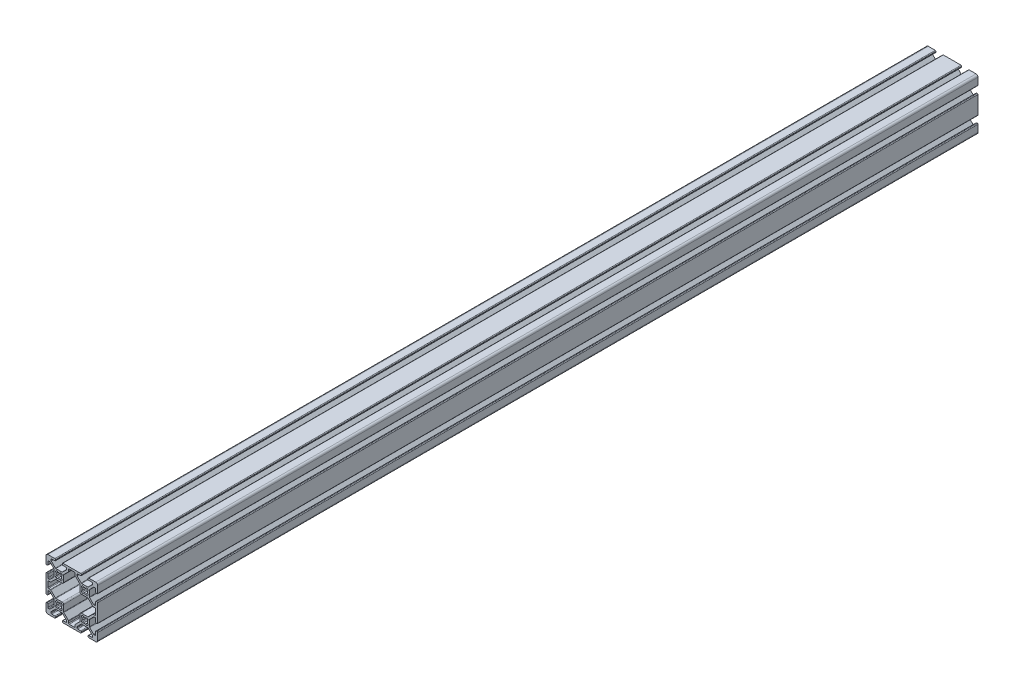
from build123d import *

# Parameters (mm, degrees)
EXTRUDE1_DEPTH = 682.117


with BuildPart() as part:
    # Sketch1 → Extrude1 (new body)
    with BuildSketch(Plane.XY):
        with BuildLine():
            Line((-36.908207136, -152.779600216), (-32.140368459, -152.779600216))
            ThreePointArc((-32.140368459, -152.779600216), (-31.945965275, -152.818269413), (-31.781158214, -152.928389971))
            Line((-31.781158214, -152.928389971), (-28.678077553, -156.031470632))
            ThreePointArc((-28.678077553, -156.031470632), (-28.567956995, -156.196277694), (-28.529287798, -156.390680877))
            Line((-28.529287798, -156.390680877), (-28.529287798, -157.116600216))
            ThreePointArc((-28.529287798, -157.116600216), (-28.678077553, -157.475810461), (-29.037287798, -157.624600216))
            Line((-29.037287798, -157.624600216), (-31.386287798, -157.624600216))
            ThreePointArc((-31.386287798, -157.624600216), (-31.745498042, -157.773389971), (-31.894287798, -158.132600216))
            Line((-31.894287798, -158.132600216), (-31.894287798, -158.616600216))
            ThreePointArc((-31.894287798, -158.616600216), (-31.745498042, -158.975810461), (-31.386287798, -159.124600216))
            Line((-31.386287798, -159.124600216), (-17.662287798, -159.124600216))
            ThreePointArc((-17.662287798, -159.124600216), (-17.303077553, -158.975810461), (-17.154287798, -158.616600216))
            Line((-17.154287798, -158.616600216), (-17.154287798, -158.132600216))
            ThreePointArc((-17.154287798, -158.132600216), (-17.303077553, -157.773389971), (-17.662287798, -157.624600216))
            Line((-17.662287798, -157.624600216), (-20.011287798, -157.624600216))
            ThreePointArc((-20.011287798, -157.624600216), (-20.370498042, -157.475810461), (-20.519287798, -157.116600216))
            Line((-20.519287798, -157.116600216), (-20.519287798, -156.390680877))
            ThreePointArc((-20.519287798, -156.390680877), (-20.4806186, -156.196277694), (-20.370498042, -156.031470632))
            Line((-20.370498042, -156.031470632), (-17.267417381, -152.928389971))
            ThreePointArc((-17.267417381, -152.928389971), (-17.10261032, -152.818269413), (-16.908207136, -152.779600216))
            Line((-16.908207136, -152.779600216), (-12.140368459, -152.779600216))
            ThreePointArc((-12.140368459, -152.779600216), (-11.945965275, -152.818269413), (-11.781158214, -152.928389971))
            Line((-11.781158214, -152.928389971), (-8.678077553, -156.031470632))
            ThreePointArc((-8.678077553, -156.031470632), (-8.567956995, -156.196277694), (-8.529287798, -156.390680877))
            Line((-8.529287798, -156.390680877), (-8.529287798, -157.116600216))
            ThreePointArc((-8.529287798, -157.116600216), (-8.678077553, -157.475810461), (-9.037287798, -157.624600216))
            Line((-9.037287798, -157.624600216), (-11.386287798, -157.624600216))
            ThreePointArc((-11.386287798, -157.624600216), (-11.745498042, -157.773389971), (-11.894287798, -158.132600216))
            Line((-11.894287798, -158.132600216), (-11.894287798, -158.616600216))
            ThreePointArc((-11.894287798, -158.616600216), (-11.745498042, -158.975810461), (-11.386287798, -159.124600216))
            Line((-11.386287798, -159.124600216), (-6.024287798, -159.124600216))
            ThreePointArc((-6.024287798, -159.124600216), (-4.963627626, -158.685260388), (-4.524287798, -157.624600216))
            Line((-4.524287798, -157.624600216), (-4.524287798, -152.262600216))
            ThreePointArc((-4.524287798, -152.262600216), (-4.673077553, -151.903389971), (-5.032287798, -151.754600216))
            Line((-5.032287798, -151.754600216), (-5.516287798, -151.754600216))
            ThreePointArc((-5.516287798, -151.754600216), (-5.875498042, -151.903389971), (-6.024287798, -152.262600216))
            Line((-6.024287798, -152.262600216), (-6.024287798, -154.611600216))
            ThreePointArc((-6.024287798, -154.611600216), (-6.173077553, -154.970810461), (-6.532287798, -155.119600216))
            Line((-6.532287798, -155.119600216), (-7.258207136, -155.119600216))
            ThreePointArc((-7.258207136, -155.119600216), (-7.45261032, -155.080931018), (-7.617417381, -154.970810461))
            Line((-7.617417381, -154.970810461), (-10.720498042, -151.867729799))
            ThreePointArc((-10.720498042, -151.867729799), (-10.8306186, -151.702922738), (-10.869287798, -151.508519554))
            Line((-10.869287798, -151.508519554), (-10.869287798, -146.740680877))
            ThreePointArc((-10.869287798, -146.740680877), (-10.8306186, -146.546277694), (-10.720498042, -146.381470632))
            Line((-10.720498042, -146.381470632), (-7.617417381, -143.278389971))
            ThreePointArc((-7.617417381, -143.278389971), (-7.45261032, -143.168269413), (-7.258207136, -143.129600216))
            Line((-7.258207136, -143.129600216), (-6.532287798, -143.129600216))
            ThreePointArc((-6.532287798, -143.129600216), (-6.173077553, -143.278389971), (-6.024287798, -143.637600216))
            Line((-6.024287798, -143.637600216), (-6.024287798, -145.986600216))
            ThreePointArc((-6.024287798, -145.986600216), (-5.875498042, -146.345810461), (-5.516287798, -146.494600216))
            Line((-5.516287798, -146.494600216), (-5.032287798, -146.494600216))
            ThreePointArc((-5.032287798, -146.494600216), (-4.673077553, -146.345810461), (-4.524287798, -145.986600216))
            Line((-4.524287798, -145.986600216), (-4.524287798, -132.262600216))
            ThreePointArc((-4.524287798, -132.262600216), (-4.673077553, -131.903389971), (-5.032287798, -131.754600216))
            Line((-5.032287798, -131.754600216), (-5.516287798, -131.754600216))
            ThreePointArc((-5.516287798, -131.754600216), (-5.875498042, -131.903389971), (-6.024287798, -132.262600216))
            Line((-6.024287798, -132.262600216), (-6.024287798, -134.611600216))
            ThreePointArc((-6.024287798, -134.611600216), (-6.173077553, -134.970810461), (-6.532287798, -135.119600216))
            Line((-6.532287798, -135.119600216), (-7.258207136, -135.119600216))
            ThreePointArc((-7.258207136, -135.119600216), (-7.45261032, -135.080931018), (-7.617417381, -134.970810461))
            Line((-7.617417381, -134.970810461), (-10.720498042, -131.867729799))
            ThreePointArc((-10.720498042, -131.867729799), (-10.8306186, -131.702922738), (-10.869287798, -131.508519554))
            Line((-10.869287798, -131.508519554), (-10.869287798, -126.740680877))
            ThreePointArc((-10.869287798, -126.740680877), (-10.8306186, -126.546277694), (-10.720498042, -126.381470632))
            Line((-10.720498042, -126.381470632), (-7.617417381, -123.278389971))
            ThreePointArc((-7.617417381, -123.278389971), (-7.45261032, -123.168269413), (-7.258207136, -123.129600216))
            Line((-7.258207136, -123.129600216), (-6.532287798, -123.129600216))
            ThreePointArc((-6.532287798, -123.129600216), (-6.173077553, -123.278389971), (-6.024287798, -123.637600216))
            Line((-6.024287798, -123.637600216), (-6.024287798, -125.986600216))
            ThreePointArc((-6.024287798, -125.986600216), (-5.875498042, -126.345810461), (-5.516287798, -126.494600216))
            Line((-5.516287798, -126.494600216), (-5.032287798, -126.494600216))
            ThreePointArc((-5.032287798, -126.494600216), (-4.673077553, -126.345810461), (-4.524287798, -125.986600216))
            Line((-4.524287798, -125.986600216), (-4.524287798, -120.624600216))
            ThreePointArc((-4.524287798, -120.624600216), (-4.963627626, -119.563940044), (-6.024287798, -119.124600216))
            Line((-6.024287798, -119.124600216), (-11.386287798, -119.124600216))
            ThreePointArc((-11.386287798, -119.124600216), (-11.745498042, -119.273389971), (-11.894287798, -119.632600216))
            Line((-11.894287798, -119.632600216), (-11.894287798, -120.116600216))
            ThreePointArc((-11.894287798, -120.116600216), (-11.745498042, -120.475810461), (-11.386287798, -120.624600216))
            Line((-11.386287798, -120.624600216), (-9.037287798, -120.624600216))
            ThreePointArc((-9.037287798, -120.624600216), (-8.678077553, -120.773389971), (-8.529287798, -121.132600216))
            Line((-8.529287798, -121.132600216), (-8.529287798, -121.858519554))
            ThreePointArc((-8.529287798, -121.858519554), (-8.567956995, -122.052922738), (-8.678077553, -122.217729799))
            Line((-8.678077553, -122.217729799), (-11.781158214, -125.320810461))
            ThreePointArc((-11.781158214, -125.320810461), (-11.945965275, -125.430931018), (-12.140368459, -125.469600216))
            Line((-12.140368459, -125.469600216), (-16.908207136, -125.469600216))
            ThreePointArc((-16.908207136, -125.469600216), (-17.10261032, -125.430931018), (-17.267417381, -125.320810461))
            Line((-17.267417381, -125.320810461), (-20.370498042, -122.217729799))
            ThreePointArc((-20.370498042, -122.217729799), (-20.4806186, -122.052922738), (-20.519287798, -121.858519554))
            Line((-20.519287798, -121.858519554), (-20.519287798, -121.132600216))
            ThreePointArc((-20.519287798, -121.132600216), (-20.370498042, -120.773389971), (-20.011287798, -120.624600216))
            Line((-20.011287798, -120.624600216), (-17.662287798, -120.624600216))
            ThreePointArc((-17.662287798, -120.624600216), (-17.303077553, -120.475810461), (-17.154287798, -120.116600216))
            Line((-17.154287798, -120.116600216), (-17.154287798, -119.632600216))
            ThreePointArc((-17.154287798, -119.632600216), (-17.303077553, -119.273389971), (-17.662287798, -119.124600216))
            Line((-17.662287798, -119.124600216), (-31.386287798, -119.124600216))
            ThreePointArc((-31.386287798, -119.124600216), (-31.745498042, -119.273389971), (-31.894287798, -119.632600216))
            Line((-31.894287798, -119.632600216), (-31.894287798, -120.116600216))
            ThreePointArc((-31.894287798, -120.116600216), (-31.745498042, -120.475810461), (-31.386287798, -120.624600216))
            Line((-31.386287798, -120.624600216), (-29.037287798, -120.624600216))
            ThreePointArc((-29.037287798, -120.624600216), (-28.678077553, -120.773389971), (-28.529287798, -121.132600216))
            Line((-28.529287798, -121.132600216), (-28.529287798, -121.858519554))
            ThreePointArc((-28.529287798, -121.858519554), (-28.567956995, -122.052922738), (-28.678077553, -122.217729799))
            Line((-28.678077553, -122.217729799), (-31.781158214, -125.320810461))
            ThreePointArc((-31.781158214, -125.320810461), (-31.945965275, -125.430931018), (-32.140368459, -125.469600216))
            Line((-32.140368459, -125.469600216), (-36.908207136, -125.469600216))
            ThreePointArc((-36.908207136, -125.469600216), (-37.10261032, -125.430931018), (-37.267417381, -125.320810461))
            Line((-37.267417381, -125.320810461), (-40.370498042, -122.217729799))
            ThreePointArc((-40.370498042, -122.217729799), (-40.4806186, -122.052922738), (-40.519287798, -121.858519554))
            Line((-40.519287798, -121.858519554), (-40.519287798, -121.132600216))
            ThreePointArc((-40.519287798, -121.132600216), (-40.370498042, -120.773389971), (-40.011287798, -120.624600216))
            Line((-40.011287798, -120.624600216), (-37.662287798, -120.624600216))
            ThreePointArc((-37.662287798, -120.624600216), (-37.303077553, -120.475810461), (-37.154287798, -120.116600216))
            Line((-37.154287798, -120.116600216), (-37.154287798, -119.632600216))
            ThreePointArc((-37.154287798, -119.632600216), (-37.303077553, -119.273389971), (-37.662287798, -119.124600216))
            Line((-37.662287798, -119.124600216), (-43.024287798, -119.124600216))
            ThreePointArc((-43.024287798, -119.124600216), (-44.084947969, -119.563940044), (-44.524287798, -120.624600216))
            Line((-44.524287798, -120.624600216), (-44.524287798, -125.986600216))
            ThreePointArc((-44.524287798, -125.986600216), (-44.375498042, -126.345810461), (-44.016287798, -126.494600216))
            Line((-44.016287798, -126.494600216), (-43.532287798, -126.494600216))
            ThreePointArc((-43.532287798, -126.494600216), (-43.173077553, -126.345810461), (-43.024287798, -125.986600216))
            Line((-43.024287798, -125.986600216), (-43.024287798, -123.637600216))
            ThreePointArc((-43.024287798, -123.637600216), (-42.875498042, -123.278389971), (-42.516287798, -123.129600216))
            Line((-42.516287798, -123.129600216), (-41.790368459, -123.129600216))
            ThreePointArc((-41.790368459, -123.129600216), (-41.595965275, -123.168269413), (-41.431158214, -123.278389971))
            Line((-41.431158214, -123.278389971), (-38.328077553, -126.381470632))
            ThreePointArc((-38.328077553, -126.381470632), (-38.217956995, -126.546277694), (-38.179287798, -126.740680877))
            Line((-38.179287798, -126.740680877), (-38.179287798, -131.508519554))
            ThreePointArc((-38.179287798, -131.508519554), (-38.217956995, -131.702922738), (-38.328077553, -131.867729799))
            Line((-38.328077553, -131.867729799), (-41.431158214, -134.970810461))
            ThreePointArc((-41.431158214, -134.970810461), (-41.595965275, -135.080931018), (-41.790368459, -135.119600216))
            Line((-41.790368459, -135.119600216), (-42.516287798, -135.119600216))
            ThreePointArc((-42.516287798, -135.119600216), (-42.875498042, -134.970810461), (-43.024287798, -134.611600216))
            Line((-43.024287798, -134.611600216), (-43.024287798, -132.262600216))
            ThreePointArc((-43.024287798, -132.262600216), (-43.173077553, -131.903389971), (-43.532287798, -131.754600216))
            Line((-43.532287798, -131.754600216), (-44.016287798, -131.754600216))
            ThreePointArc((-44.016287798, -131.754600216), (-44.375498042, -131.903389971), (-44.524287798, -132.262600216))
            Line((-44.524287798, -132.262600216), (-44.524287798, -145.986600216))
            ThreePointArc((-44.524287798, -145.986600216), (-44.375498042, -146.345810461), (-44.016287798, -146.494600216))
            Line((-44.016287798, -146.494600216), (-43.532287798, -146.494600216))
            ThreePointArc((-43.532287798, -146.494600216), (-43.173077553, -146.345810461), (-43.024287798, -145.986600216))
            Line((-43.024287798, -145.986600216), (-43.024287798, -143.637600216))
            ThreePointArc((-43.024287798, -143.637600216), (-42.875498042, -143.278389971), (-42.516287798, -143.129600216))
            Line((-42.516287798, -143.129600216), (-41.790368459, -143.129600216))
            ThreePointArc((-41.790368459, -143.129600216), (-41.595965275, -143.168269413), (-41.431158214, -143.278389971))
            Line((-41.431158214, -143.278389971), (-38.328077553, -146.381470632))
            ThreePointArc((-38.328077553, -146.381470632), (-38.217956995, -146.546277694), (-38.179287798, -146.740680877))
            Line((-38.179287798, -146.740680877), (-38.179287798, -151.508519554))
            ThreePointArc((-38.179287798, -151.508519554), (-38.217956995, -151.702922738), (-38.328077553, -151.867729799))
            Line((-38.328077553, -151.867729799), (-41.431158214, -154.970810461))
            ThreePointArc((-41.431158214, -154.970810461), (-41.595965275, -155.080931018), (-41.790368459, -155.119600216))
            Line((-41.790368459, -155.119600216), (-42.516287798, -155.119600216))
            ThreePointArc((-42.516287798, -155.119600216), (-42.875498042, -154.970810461), (-43.024287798, -154.611600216))
            Line((-43.024287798, -154.611600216), (-43.024287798, -152.262600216))
            ThreePointArc((-43.024287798, -152.262600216), (-43.173077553, -151.903389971), (-43.532287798, -151.754600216))
            Line((-43.532287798, -151.754600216), (-44.016287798, -151.754600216))
            ThreePointArc((-44.016287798, -151.754600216), (-44.375498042, -151.903389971), (-44.524287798, -152.262600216))
            Line((-44.524287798, -152.262600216), (-44.524287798, -157.624600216))
            ThreePointArc((-44.524287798, -157.624600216), (-44.084947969, -158.685260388), (-43.024287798, -159.124600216))
            Line((-43.024287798, -159.124600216), (-37.662287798, -159.124600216))
            ThreePointArc((-37.662287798, -159.124600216), (-37.303077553, -158.975810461), (-37.154287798, -158.616600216))
            Line((-37.154287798, -158.616600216), (-37.154287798, -158.132600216))
            ThreePointArc((-37.154287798, -158.132600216), (-37.303077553, -157.773389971), (-37.662287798, -157.624600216))
            Line((-37.662287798, -157.624600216), (-40.011287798, -157.624600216))
            ThreePointArc((-40.011287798, -157.624600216), (-40.370498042, -157.475810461), (-40.519287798, -157.116600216))
            Line((-40.519287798, -157.116600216), (-40.519287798, -156.390680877))
            ThreePointArc((-40.519287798, -156.390680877), (-40.4806186, -156.196277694), (-40.370498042, -156.031470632))
            Line((-40.370498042, -156.031470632), (-37.267417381, -152.928389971))
            ThreePointArc((-37.267417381, -152.928389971), (-37.10261032, -152.818269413), (-36.908207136, -152.779600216))
        make_face()
        with BuildLine():
            Line((-16.649188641, -131.429106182), (-16.828793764, -131.249501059))
            ThreePointArc((-16.828793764, -131.249501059), (-17.030225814, -130.481068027), (-16.459421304, -129.928576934))
            ThreePointArc((-16.459421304, -129.928576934), (-16.619787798, -129.124600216), (-16.459421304, -128.320623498))
            ThreePointArc((-16.459421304, -128.320623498), (-17.030225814, -127.768132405), (-16.828793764, -126.999699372))
            Line((-16.828793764, -126.999699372), (-16.649188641, -126.82009425))
            ThreePointArc((-16.649188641, -126.82009425), (-15.880755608, -126.618662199), (-15.328264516, -127.18946671))
            ThreePointArc((-15.328264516, -127.18946671), (-14.524287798, -127.029100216), (-13.72031108, -127.18946671))
            ThreePointArc((-13.72031108, -127.18946671), (-13.167819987, -126.618662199), (-12.399386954, -126.82009425))
            Line((-12.399386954, -126.82009425), (-12.219781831, -126.999699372))
            ThreePointArc((-12.219781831, -126.999699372), (-12.018349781, -127.768132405), (-12.589154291, -128.320623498))
            ThreePointArc((-12.589154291, -128.320623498), (-12.428787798, -129.124600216), (-12.589154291, -129.928576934))
            ThreePointArc((-12.589154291, -129.928576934), (-12.018349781, -130.481068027), (-12.219781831, -131.249501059))
            Line((-12.219781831, -131.249501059), (-12.399386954, -131.429106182))
            ThreePointArc((-12.399386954, -131.429106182), (-13.167819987, -131.630538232), (-13.72031108, -131.059733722))
            ThreePointArc((-13.72031108, -131.059733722), (-14.524287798, -131.220100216), (-15.328264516, -131.059733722))
            ThreePointArc((-15.328264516, -131.059733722), (-15.880755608, -131.630538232), (-16.649188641, -131.429106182))
        make_face(mode=Mode.SUBTRACT)
        with BuildLine():
            Line((-36.649188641, -131.429106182), (-36.828793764, -131.249501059))
            ThreePointArc((-36.828793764, -131.249501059), (-37.030225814, -130.481068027), (-36.459421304, -129.928576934))
            ThreePointArc((-36.459421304, -129.928576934), (-36.619787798, -129.124600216), (-36.459421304, -128.320623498))
            ThreePointArc((-36.459421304, -128.320623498), (-37.030225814, -127.768132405), (-36.828793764, -126.999699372))
            Line((-36.828793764, -126.999699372), (-36.649188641, -126.82009425))
            ThreePointArc((-36.649188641, -126.82009425), (-35.880755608, -126.618662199), (-35.328264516, -127.18946671))
            ThreePointArc((-35.328264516, -127.18946671), (-34.524287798, -127.029100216), (-33.72031108, -127.18946671))
            ThreePointArc((-33.72031108, -127.18946671), (-33.167819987, -126.618662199), (-32.399386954, -126.82009425))
            Line((-32.399386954, -126.82009425), (-32.219781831, -126.999699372))
            ThreePointArc((-32.219781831, -126.999699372), (-32.018349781, -127.768132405), (-32.589154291, -128.320623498))
            ThreePointArc((-32.589154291, -128.320623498), (-32.428787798, -129.124600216), (-32.589154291, -129.928576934))
            ThreePointArc((-32.589154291, -129.928576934), (-32.018349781, -130.481068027), (-32.219781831, -131.249501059))
            Line((-32.219781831, -131.249501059), (-32.399386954, -131.429106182))
            ThreePointArc((-32.399386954, -131.429106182), (-33.167819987, -131.630538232), (-33.72031108, -131.059733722))
            ThreePointArc((-33.72031108, -131.059733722), (-34.524287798, -131.220100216), (-35.328264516, -131.059733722))
            ThreePointArc((-35.328264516, -131.059733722), (-35.880755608, -131.630538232), (-36.649188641, -131.429106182))
        make_face(mode=Mode.SUBTRACT)
        with BuildLine():
            Line((-16.649188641, -151.429106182), (-16.828793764, -151.249501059))
            ThreePointArc((-16.828793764, -151.249501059), (-17.030225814, -150.481068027), (-16.459421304, -149.928576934))
            ThreePointArc((-16.459421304, -149.928576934), (-16.619787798, -149.124600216), (-16.459421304, -148.320623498))
            ThreePointArc((-16.459421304, -148.320623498), (-17.030225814, -147.768132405), (-16.828793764, -146.999699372))
            Line((-16.828793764, -146.999699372), (-16.649188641, -146.82009425))
            ThreePointArc((-16.649188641, -146.82009425), (-15.880755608, -146.618662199), (-15.328264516, -147.18946671))
            ThreePointArc((-15.328264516, -147.18946671), (-14.524287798, -147.029100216), (-13.72031108, -147.18946671))
            ThreePointArc((-13.72031108, -147.18946671), (-13.167819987, -146.618662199), (-12.399386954, -146.82009425))
            Line((-12.399386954, -146.82009425), (-12.219781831, -146.999699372))
            ThreePointArc((-12.219781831, -146.999699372), (-12.018349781, -147.768132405), (-12.589154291, -148.320623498))
            ThreePointArc((-12.589154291, -148.320623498), (-12.428787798, -149.124600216), (-12.589154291, -149.928576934))
            ThreePointArc((-12.589154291, -149.928576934), (-12.018349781, -150.481068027), (-12.219781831, -151.249501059))
            Line((-12.219781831, -151.249501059), (-12.399386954, -151.429106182))
            ThreePointArc((-12.399386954, -151.429106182), (-13.167819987, -151.630538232), (-13.72031108, -151.059733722))
            ThreePointArc((-13.72031108, -151.059733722), (-14.524287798, -151.220100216), (-15.328264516, -151.059733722))
            ThreePointArc((-15.328264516, -151.059733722), (-15.880755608, -151.630538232), (-16.649188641, -151.429106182))
        make_face(mode=Mode.SUBTRACT)
        with BuildLine():
            Line((-27.029287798, -157.116600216), (-27.029287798, -155.769360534))
            ThreePointArc((-27.029287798, -155.769360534), (-27.067956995, -155.57495735), (-27.178077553, -155.410150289))
            Line((-27.178077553, -155.410150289), (-30.720498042, -151.867729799))
            ThreePointArc((-30.720498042, -151.867729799), (-30.8306186, -151.702922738), (-30.869287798, -151.508519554))
            Line((-30.869287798, -151.508519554), (-30.869287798, -146.612600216))
            ThreePointArc((-30.869287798, -146.612600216), (-31.204064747, -145.804377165), (-32.012287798, -145.469600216))
            Line((-32.012287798, -145.469600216), (-36.908207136, -145.469600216))
            ThreePointArc((-36.908207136, -145.469600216), (-37.10261032, -145.430931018), (-37.267417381, -145.320810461))
            Line((-37.267417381, -145.320810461), (-40.809837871, -141.778389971))
            ThreePointArc((-40.809837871, -141.778389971), (-40.974644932, -141.668269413), (-41.169048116, -141.629600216))
            Line((-41.169048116, -141.629600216), (-42.516287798, -141.629600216))
            ThreePointArc((-42.516287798, -141.629600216), (-42.875498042, -141.480810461), (-43.024287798, -141.121600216))
            Line((-43.024287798, -141.121600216), (-43.024287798, -137.127600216))
            ThreePointArc((-43.024287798, -137.127600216), (-42.875498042, -136.768389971), (-42.516287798, -136.619600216))
            Line((-42.516287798, -136.619600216), (-41.169048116, -136.619600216))
            ThreePointArc((-41.169048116, -136.619600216), (-40.974644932, -136.580931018), (-40.809837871, -136.470810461))
            Line((-40.809837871, -136.470810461), (-37.267417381, -132.928389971))
            ThreePointArc((-37.267417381, -132.928389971), (-37.10261032, -132.818269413), (-36.908207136, -132.779600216))
            Line((-36.908207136, -132.779600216), (-32.012287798, -132.779600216))
            ThreePointArc((-32.012287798, -132.779600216), (-31.204064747, -132.444823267), (-30.869287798, -131.636600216))
            Line((-30.869287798, -131.636600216), (-30.869287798, -126.740680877))
            ThreePointArc((-30.869287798, -126.740680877), (-30.8306186, -126.546277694), (-30.720498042, -126.381470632))
            Line((-30.720498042, -126.381470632), (-27.178077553, -122.839050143))
            ThreePointArc((-27.178077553, -122.839050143), (-27.067956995, -122.674243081), (-27.029287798, -122.479839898))
            Line((-27.029287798, -122.479839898), (-27.029287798, -121.132600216))
            ThreePointArc((-27.029287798, -121.132600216), (-26.880498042, -120.773389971), (-26.521287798, -120.624600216))
            Line((-26.521287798, -120.624600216), (-22.527287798, -120.624600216))
            ThreePointArc((-22.527287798, -120.624600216), (-22.168077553, -120.773389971), (-22.019287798, -121.132600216))
            Line((-22.019287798, -121.132600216), (-22.019287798, -122.479839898))
            ThreePointArc((-22.019287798, -122.479839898), (-21.9806186, -122.674243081), (-21.870498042, -122.839050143))
            Line((-21.870498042, -122.839050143), (-18.328077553, -126.381470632))
            ThreePointArc((-18.328077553, -126.381470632), (-18.217956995, -126.546277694), (-18.179287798, -126.740680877))
            Line((-18.179287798, -126.740680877), (-18.179287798, -131.636600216))
            ThreePointArc((-18.179287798, -131.636600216), (-17.844510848, -132.444823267), (-17.036287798, -132.779600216))
            Line((-17.036287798, -132.779600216), (-12.140368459, -132.779600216))
            ThreePointArc((-12.140368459, -132.779600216), (-11.945965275, -132.818269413), (-11.781158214, -132.928389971))
            Line((-11.781158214, -132.928389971), (-8.238737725, -136.470810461))
            ThreePointArc((-8.238737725, -136.470810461), (-8.073930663, -136.580931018), (-7.87952748, -136.619600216))
            Line((-7.87952748, -136.619600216), (-6.532287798, -136.619600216))
            ThreePointArc((-6.532287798, -136.619600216), (-6.173077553, -136.768389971), (-6.024287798, -137.127600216))
            Line((-6.024287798, -137.127600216), (-6.024287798, -141.121600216))
            ThreePointArc((-6.024287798, -141.121600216), (-6.173077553, -141.480810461), (-6.532287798, -141.629600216))
            Line((-6.532287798, -141.629600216), (-7.87952748, -141.629600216))
            ThreePointArc((-7.87952748, -141.629600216), (-8.073930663, -141.668269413), (-8.238737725, -141.778389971))
            Line((-8.238737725, -141.778389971), (-11.781158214, -145.320810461))
            ThreePointArc((-11.781158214, -145.320810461), (-11.945965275, -145.430931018), (-12.140368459, -145.469600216))
            Line((-12.140368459, -145.469600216), (-17.036287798, -145.469600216))
            ThreePointArc((-17.036287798, -145.469600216), (-17.844510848, -145.804377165), (-18.179287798, -146.612600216))
            Line((-18.179287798, -146.612600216), (-18.179287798, -151.508519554))
            ThreePointArc((-18.179287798, -151.508519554), (-18.217956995, -151.702922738), (-18.328077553, -151.867729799))
            Line((-18.328077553, -151.867729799), (-21.870498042, -155.410150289))
            ThreePointArc((-21.870498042, -155.410150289), (-21.9806186, -155.57495735), (-22.019287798, -155.769360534))
            Line((-22.019287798, -155.769360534), (-22.019287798, -157.116600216))
            ThreePointArc((-22.019287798, -157.116600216), (-22.168077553, -157.475810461), (-22.527287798, -157.624600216))
            Line((-22.527287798, -157.624600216), (-26.521287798, -157.624600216))
            ThreePointArc((-26.521287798, -157.624600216), (-26.880498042, -157.475810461), (-27.029287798, -157.116600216))
        make_face(mode=Mode.SUBTRACT)
        with BuildLine():
            Line((-36.649188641, -151.429106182), (-36.828793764, -151.249501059))
            ThreePointArc((-36.828793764, -151.249501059), (-37.030225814, -150.481068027), (-36.459421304, -149.928576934))
            ThreePointArc((-36.459421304, -149.928576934), (-36.619787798, -149.124600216), (-36.459421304, -148.320623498))
            ThreePointArc((-36.459421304, -148.320623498), (-37.030225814, -147.768132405), (-36.828793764, -146.999699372))
            Line((-36.828793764, -146.999699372), (-36.649188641, -146.82009425))
            ThreePointArc((-36.649188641, -146.82009425), (-35.880755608, -146.618662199), (-35.328264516, -147.18946671))
            ThreePointArc((-35.328264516, -147.18946671), (-34.524287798, -147.029100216), (-33.72031108, -147.18946671))
            ThreePointArc((-33.72031108, -147.18946671), (-33.167819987, -146.618662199), (-32.399386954, -146.82009425))
            Line((-32.399386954, -146.82009425), (-32.219781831, -146.999699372))
            ThreePointArc((-32.219781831, -146.999699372), (-32.018349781, -147.768132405), (-32.589154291, -148.320623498))
            ThreePointArc((-32.589154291, -148.320623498), (-32.428787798, -149.124600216), (-32.589154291, -149.928576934))
            ThreePointArc((-32.589154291, -149.928576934), (-32.018349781, -150.481068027), (-32.219781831, -151.249501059))
            Line((-32.219781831, -151.249501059), (-32.399386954, -151.429106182))
            ThreePointArc((-32.399386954, -151.429106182), (-33.167819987, -151.630538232), (-33.72031108, -151.059733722))
            ThreePointArc((-33.72031108, -151.059733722), (-34.524287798, -151.220100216), (-35.328264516, -151.059733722))
            ThreePointArc((-35.328264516, -151.059733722), (-35.880755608, -151.630538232), (-36.649188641, -151.429106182))
        make_face(mode=Mode.SUBTRACT)
    extrude(amount=EXTRUDE1_DEPTH)


solid = part.part
